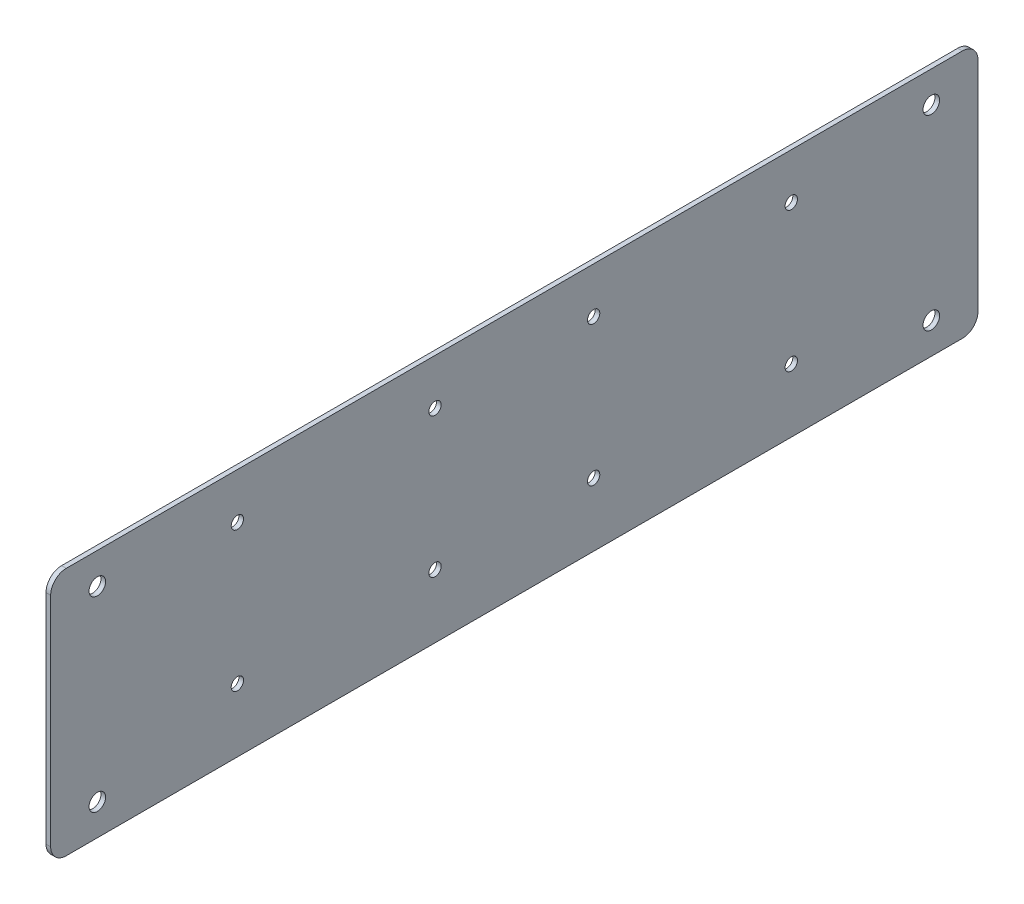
from build123d import *

# Parameters (mm, degrees)
BOSS_EXTRUDE1_DEPTH     = 1.905
CUT_EXTRUDE1_DEPTH      = 602.407374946
CUT_EXTRUDE1_DEPTH_BACK = 602.407374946
SKETCH2_R               = 3.3782
CUT_EXTRUDE2_DEPTH      = 602.407374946
CUT_EXTRUDE2_DEPTH_BACK = 602.407374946
SKETCH3_R               = 2.5146


with BuildPart() as part:
    # Sketch1 → Boss-Extrude1 (new body)
    with BuildSketch(Plane.ZY.offset(51.742318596)):
        with BuildLine():
            Line((106.238026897, 364.513877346), (471.998026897, 364.513877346))
            ThreePointArc((471.998026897, 364.513877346), (476.488154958, 362.654005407), (478.348026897, 358.163877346))
            Line((478.348026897, 358.163877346), (478.348026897, 269.263877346))
            ThreePointArc((478.348026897, 269.263877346), (476.488154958, 264.773749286), (471.998026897, 262.913877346))
            Line((471.998026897, 262.913877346), (106.238026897, 262.913877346))
            ThreePointArc((106.238026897, 262.913877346), (101.747898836, 264.773749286), (99.888026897, 269.263877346))
            Line((99.888026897, 269.263877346), (99.888026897, 358.163877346))
            ThreePointArc((99.888026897, 358.163877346), (101.747898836, 362.654005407), (106.238026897, 364.513877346))
        make_face()
    extrude(amount=BOSS_EXTRUDE1_DEPTH)

    # Sketch2 → Cut-Extrude1 (cut, two sides: drawn at the far end of the back side and taken through both)
    with BuildSketch(Plane(origin=(-51.742318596, 0, 0), x_dir=(0, 0, -1), z_dir=(1, 0, 0)).offset(-CUT_EXTRUDE1_DEPTH_BACK)):
        with Locations(Location((-459.298026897, 351.813877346, 0), (0, 0, 90))):
            Circle(SKETCH2_R)
        with Locations(Location((-118.938026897, 351.813877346, 0), (0, 0, 90))):
            Circle(SKETCH2_R)
        with Locations(Location((-118.938026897, 275.613877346, 0), (0, 0, 90))):
            Circle(SKETCH2_R)
        with Locations(Location((-459.298026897, 275.613877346, 0), (0, 0, 90))):
            Circle(SKETCH2_R)
    extrude(amount=CUT_EXTRUDE1_DEPTH + CUT_EXTRUDE1_DEPTH_BACK, mode=Mode.SUBTRACT)

    # Sketch3 → Cut-Extrude2 (cut, two sides: drawn at the far end of the back side and taken through both)
    with BuildSketch(Plane.ZY.offset(53.647318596).offset(-CUT_EXTRUDE2_DEPTH_BACK)):
        with Locations(Location((176.088026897, 345.844877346, 0), (0, 0, 270))):
            Circle(SKETCH3_R)
        with Locations(Location((176.088026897, 288.796477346, 0), (0, 0, 270))):
            Circle(SKETCH3_R)
        with Locations(Location((256.758426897, 288.796477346, 0), (0, 0, 270))):
            Circle(SKETCH3_R)
        with Locations(Location((256.758426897, 345.844877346, 0), (0, 0, 270))):
            Circle(SKETCH3_R)
        with Locations(Location((402.148026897, 345.844877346, 0), (0, 0, 270))):
            Circle(SKETCH3_R)
        with Locations(Location((321.477626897, 345.844877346, 0), (0, 0, 270))):
            Circle(SKETCH3_R)
        with Locations(Location((321.477626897, 288.796477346, 0), (0, 0, 270))):
            Circle(SKETCH3_R)
        with Locations(Location((402.148026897, 288.796477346, 0), (0, 0, 270))):
            Circle(SKETCH3_R)
    extrude(amount=CUT_EXTRUDE2_DEPTH + CUT_EXTRUDE2_DEPTH_BACK, mode=Mode.SUBTRACT)


solid = part.part
